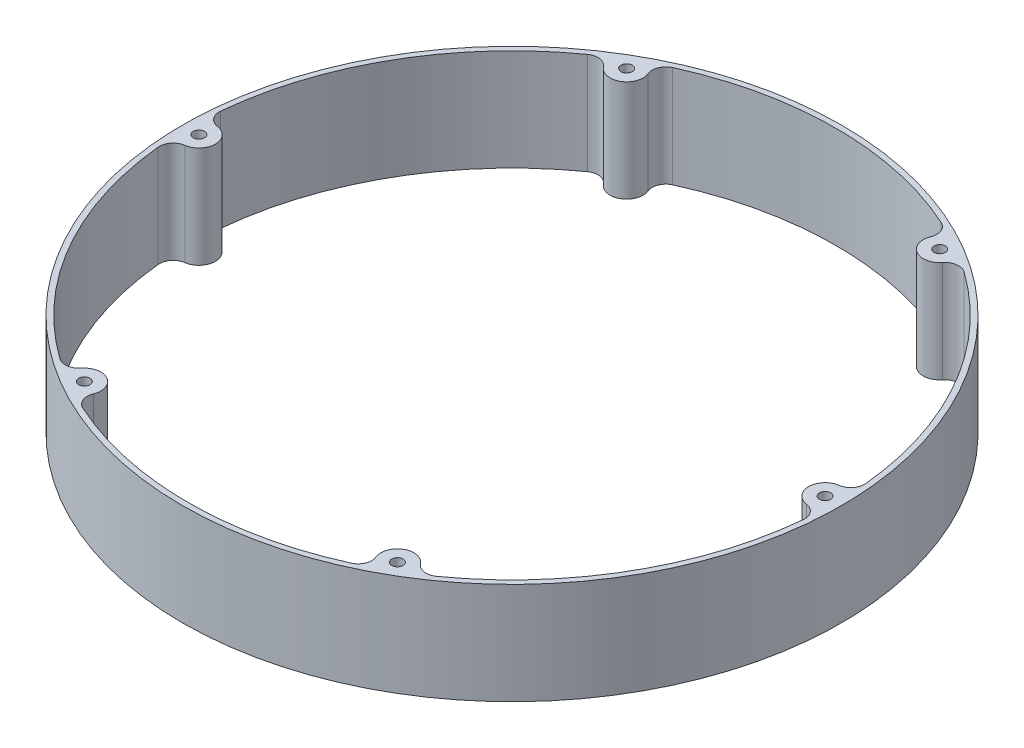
from build123d import *

# Parameters (mm, degrees)
SKETCH_1_R           = 60
SKETCH_1_R_2         = 59
EXTRUDE_1_DEPTH      = 18.5
SKETCH_2_R           = 3
EXTRUDE_2_DEPTH      = 18.5
FILLET_1_R           = 2.5
HOLE_WIZARD_M2_5_1_D = 2.05


with BuildPart() as part:
    # Sketch 1 → Extrude 1 (new body)
    with BuildSketch(Plane(origin=(0, 0, 0), x_dir=(1, 0, 0), z_dir=(0, 1, 0))):
        with Locations(Location((0, 0, 0), (0, 0, 270))):
            Circle(SKETCH_1_R)
        with Locations(Location((0, 0, 0), (0, 0, 270))):
            Circle(SKETCH_1_R_2, mode=Mode.SUBTRACT)
    extrude(amount=EXTRUDE_1_DEPTH)

    # Sketch 2 → Extrude 2 (add)
    with BuildSketch(Plane(origin=(0, 18.5, 0), x_dir=(1, 0, 0), z_dir=(0, 1, 0))):
        with Locations((-57, 0)):
            Circle(SKETCH_2_R)
        with Locations((-28.5, 49.363448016)):
            Circle(SKETCH_2_R)
        with Locations((28.5, 49.363448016)):
            Circle(SKETCH_2_R)
        with Locations((57, 0)):
            Circle(SKETCH_2_R)
        with Locations((28.5, -49.363448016)):
            Circle(SKETCH_2_R)
        with Locations((-28.5, -49.363448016)):
            Circle(SKETCH_2_R)
    extrude(amount=-EXTRUDE_2_DEPTH)

    # Fillet 1
    fillet_1_edges = [part.edges().sort_by_distance(p)[0] for p in [
        (-58.956140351, 9.25, 2.274536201),
        (-58.956140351, 9.25, -2.274536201),
        (-31.447876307, 9.25, -49.920247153),
        (-27.508264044, 9.25, -52.194783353),
        (31.447876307, 9.25, -49.920247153),
        (27.508264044, 9.25, -52.194783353),
        (58.956140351, 9.25, 2.274536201),
        (58.956140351, 9.25, -2.274536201),
        (27.508264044, 9.25, 52.194783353),
        (31.447876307, 9.25, 49.920247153),
        (-31.447876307, 9.25, 49.920247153),
        (-27.508264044, 9.25, 52.194783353),
    ]]
    fillet(fillet_1_edges, radius=FILLET_1_R)

    # Hole Wizard M2.5 _1 (through all)
    with Locations(Plane(origin=(28.5, 0, 49.363448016), x_dir=(0, 0, -1), z_dir=(0, -1, 0))):
        with Locations((0, 0), (0, -57), (49.363448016, -85.5), (98.726896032, -57), (98.726896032, 0), (49.363448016, 28.5)):
            Hole(HOLE_WIZARD_M2_5_1_D / 2)


solid = part.part
